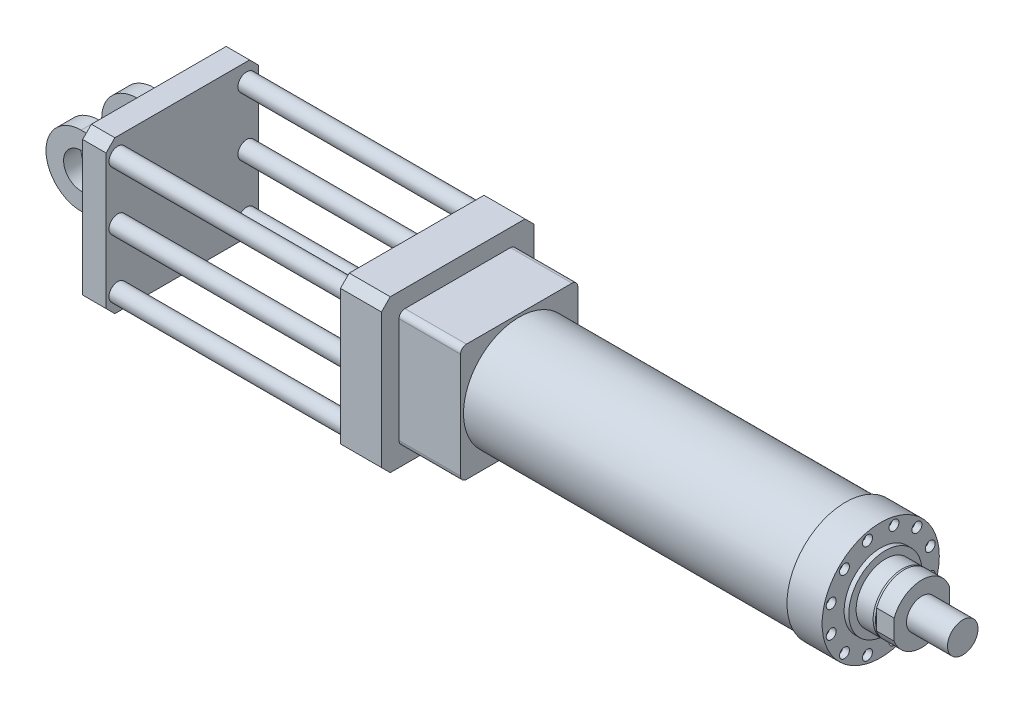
from build123d import *

# Parameters (mm, degrees)
SKETCH_1_R          = 95
SKETCH_1_R_2        = 80
EXTRUDE_1_DEPTH     = 557
SKETCH_2_R          = 100
EXTRUDE_2_DEPTH     = 60
SKETCH_3_R          = 62.5
EXTRUDE_3_DEPTH     = 8
SKETCH_4_R          = 8.5
CUT_EXTRUDE_3_DEPTH = 11
SKETCH_6_R          = 50
EXTRUDE_4_DEPTH     = 32
CHAMFER_1_SIZE      = 3
CHAMFER_1_SIZE2     = 1.091910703
EXTRUDE_5_DEPTH     = 30
SKETCH_8_R          = 26
CUT_EXTRUDE_4_DEPTH = 82
EXTRUDE_6_DEPTH     = 105
SKETCH_10_W         = 260
SKETCH_10_H         = 260
EXTRUDE_7_DEPTH     = 70
SKETCH_11_R         = 65
CUT_EXTRUDE_5_DEPTH = 30
SKETCH_12_R         = 55
CUT_EXTRUDE_6_DEPTH = 31
SKETCH_13_R         = 5
CUT_EXTRUDE_7_DEPTH = 20
EXTRUDE_START       = 70
SKETCH_14_R         = 26
EXTRUDE_8_DEPTH     = 70
EXTRUDE_START_2     = 400
SKETCH_15_W         = 260
SKETCH_15_H         = 260
EXTRUDE_9_DEPTH     = 40
SKETCH_16_R         = 15
EXTRUDE_10_DEPTH    = 400
SKETCH_17_W         = 30
SKETCH_17_H         = 120
EXTRUDE_11_DEPTH    = 130
SKETCH_18_R         = 30
CUT_EXTRUDE_8_DEPTH = 130
CHAMFER_2_SIZE      = 10
CHAMFER_3_SIZE      = 15
CHAMFER_4_SIZE      = 15


with BuildPart() as part:
    # Sketch 1 → Extrude 1 (new body)
    with BuildSketch(Plane(origin=(0, 0, 0), x_dir=(0, 0, -1), z_dir=(1, 0, 0))):
        Circle(SKETCH_1_R)
        Circle(SKETCH_1_R_2, mode=Mode.SUBTRACT)
    extrude(amount=EXTRUDE_1_DEPTH)

    # Sketch 2 → Extrude 2 (add)
    with BuildSketch(Plane(origin=(557, 0, 0), x_dir=(0, 0, -1), z_dir=(1, 0, 0))):
        Circle(SKETCH_2_R)
    extrude(amount=EXTRUDE_2_DEPTH)

    # Sketch 3 → Extrude 3 (add)
    with BuildSketch(Plane(origin=(617, 0, 0), x_dir=(0, 0, -1), z_dir=(1, 0, 0))):
        Circle(SKETCH_3_R)
    extrude(amount=EXTRUDE_3_DEPTH)

    # Sketch 4 → Cut-Extrude 3 (cut)
    with BuildSketch(Plane(origin=(617, 0, 0), x_dir=(0, 0, -1), z_dir=(1, 0, 0))):
        with Locations((-22.646666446, 84.5185098)):
            Circle(SKETCH_4_R)
        with Locations((22.646666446, 84.5185098)):
            Circle(SKETCH_4_R)
        with Locations((61.871843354, 61.871843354)):
            Circle(SKETCH_4_R)
        with Locations((84.5185098, 22.646666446)):
            Circle(SKETCH_4_R)
        with Locations((84.5185098, -22.646666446)):
            Circle(SKETCH_4_R)
        with Locations((61.871843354, -61.871843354)):
            Circle(SKETCH_4_R)
        with Locations((22.646666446, -84.5185098)):
            Circle(SKETCH_4_R)
        with Locations((-22.646666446, -84.5185098)):
            Circle(SKETCH_4_R)
        with Locations((-61.871843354, -61.871843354)):
            Circle(SKETCH_4_R)
        with Locations((-84.5185098, -22.646666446)):
            Circle(SKETCH_4_R)
        with Locations((-84.5185098, 22.646666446)):
            Circle(SKETCH_4_R)
        with Locations((-61.871843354, 61.871843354)):
            Circle(SKETCH_4_R)
    extrude(amount=-CUT_EXTRUDE_3_DEPTH, mode=Mode.SUBTRACT)

    # Sketch 6 → Extrude 4 (add)
    with BuildSketch(Plane(origin=(625, 0, 0), x_dir=(0, 0, -1), z_dir=(1, 0, 0))):
        Circle(SKETCH_6_R)
    extrude(amount=EXTRUDE_4_DEPTH)

    # Chamfer 1
    chamfer_1_edges = [part.edges().sort_by_distance(p)[0] for p in [
        (657, 0, 50),
    ]]
    chamfer_1_side = [part.faces().sort_by_distance(p)[0] for p in [
        (641, 0, 50),
    ]]
    chamfer(chamfer_1_edges, length=CHAMFER_1_SIZE, length2=CHAMFER_1_SIZE2, reference=chamfer_1_side[0])

    # Sketch 7 → Extrude 5 (add)
    with BuildSketch(Plane(origin=(657, 0, 0), x_dir=(0, 0, -1), z_dir=(1, 0, 0))):
        with BuildLine():
            Line((-47, 17.058722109), (-47, -17.058722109))
            ThreePointArc((-47, -17.058722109), (0, -50), (47, -17.058722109))
            Line((47, -17.058722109), (47, 17.058722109))
            ThreePointArc((47, 17.058722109), (0, 50), (-47, 17.058722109))
        make_face()
    extrude(amount=EXTRUDE_5_DEPTH)

    # Sketch 8 → Cut-Extrude 4 (cut)
    with BuildSketch(Plane(origin=(687, 0, 0), x_dir=(0, 0, -1), z_dir=(1, 0, 0))):
        Circle(SKETCH_8_R)
    extrude(amount=-CUT_EXTRUDE_4_DEPTH, mode=Mode.SUBTRACT)

    # Sketch 9 → Extrude 6 (add)
    with BuildSketch(Plane.ZY):
        with BuildLine():
            Line((-90, 100), (90, 100))
            ThreePointArc((90, 100), (97.071067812, 97.071067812), (100, 90))
            Line((100, 90), (100, -90))
            ThreePointArc((100, -90), (97.071067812, -97.071067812), (90, -100))
            Line((90, -100), (-90, -100))
            ThreePointArc((-90, -100), (-97.071067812, -97.071067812), (-100, -90))
            Line((-100, -90), (-100, 90))
            ThreePointArc((-100, 90), (-97.071067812, 97.071067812), (-90, 100))
        make_face()
    extrude(amount=EXTRUDE_6_DEPTH)


with BuildPart() as body_2:
    # Sketch 10 → Extrude 7 (new body)
    with BuildSketch(Plane.ZY.offset(105)):
        Rectangle(SKETCH_10_W, SKETCH_10_H)
    extrude(amount=EXTRUDE_7_DEPTH)

    # Sketch 11 → Cut-Extrude 5 (cut)
    with BuildSketch(Plane.ZY.offset(175)):
        Circle(SKETCH_11_R)
    extrude(amount=-CUT_EXTRUDE_5_DEPTH, mode=Mode.SUBTRACT)

    # Sketch 12 → Cut-Extrude 6 (cut)
    with BuildSketch(Plane.ZY.offset(145)):
        Circle(SKETCH_12_R)
    extrude(amount=-CUT_EXTRUDE_6_DEPTH, mode=Mode.SUBTRACT)

    # Sketch 13 → Cut-Extrude 7 (cut)
    with BuildSketch(Plane.ZY.offset(175)):
        with Locations((-58.336309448, 58.336309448)):
            Circle(SKETCH_13_R)
        with Locations((58.336309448, 58.336309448)):
            Circle(SKETCH_13_R)
        with Locations((58.336309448, -58.336309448)):
            Circle(SKETCH_13_R)
        with Locations((-58.336309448, -58.336309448)):
            Circle(SKETCH_13_R)
    extrude(amount=-CUT_EXTRUDE_7_DEPTH, mode=Mode.SUBTRACT)

    # Sketch 16 → Extrude 10 (add)
    with BuildSketch(Plane.ZY.offset(175)):
        with Locations((110, 100)):
            Circle(SKETCH_16_R)
        with Locations((110, -100)):
            Circle(SKETCH_16_R)
        with Locations((-110, 0)):
            Circle(SKETCH_16_R)
        with Locations(Location((-110, -100, 0), (0, 0, 180))):
            Circle(SKETCH_16_R)
        with Locations(Location((-110, 100, 0), (0, 0, 180))):
            Circle(SKETCH_16_R)
        with Locations((110, 0)):
            Circle(SKETCH_16_R)
    extrude(amount=EXTRUDE_10_DEPTH)

    # Chamfer 3
    chamfer_3_edges = [body_2.edges().sort_by_distance(p)[0] for p in [
        (-140, -130, 130),
        (-140, -130, -130),
        (-140, 130, -130),
        (-140, 130, 130),
    ]]
    chamfer(chamfer_3_edges, length=CHAMFER_3_SIZE)


with BuildPart() as body_3:
    # Sketch 14 → Extrude 8 (new body)
    with BuildSketch(Plane(origin=(687, 0, 0), x_dir=(0, 0, -1), z_dir=(1, 0, 0)).offset(EXTRUDE_START)):
        Circle(SKETCH_14_R)
    extrude(amount=-EXTRUDE_8_DEPTH)


with BuildPart() as body_4:
    # Sketch 15 → Extrude 9 (new body)
    with BuildSketch(Plane.ZY.offset(175).offset(EXTRUDE_START_2)):
        Rectangle(SKETCH_15_W, SKETCH_15_H)
    extrude(amount=EXTRUDE_9_DEPTH)

    # Sketch 17 → Extrude 11 (add)
    with BuildSketch(Plane.ZY.offset(615)):
        with Locations((-47.5, 0)):
            Rectangle(SKETCH_17_W, SKETCH_17_H)
        with Locations((47.5, 0)):
            Rectangle(SKETCH_17_W, SKETCH_17_H)
    extrude(amount=EXTRUDE_11_DEPTH)

    # Sketch 18 → Cut-Extrude 8 (cut)
    with BuildSketch(Plane.XY.offset(62.5)):
        with Locations((-685, 0)):
            Circle(SKETCH_18_R)
        with BuildLine():
            Line((-685, 60), (-850.932928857, 82.095369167))
            Line((-850.932928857, 82.095369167), (-803.822889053, -103.100854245))
            Line((-803.822889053, -103.100854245), (-685, -60))
            ThreePointArc((-685, -60), (-745, 0), (-685, 60))
        make_face()
    extrude(amount=-CUT_EXTRUDE_8_DEPTH, mode=Mode.SUBTRACT)

    # Chamfer 2
    chamfer_2_edges = [body_4.edges().sort_by_distance(p)[0] for p in [
        (-615, 0, -32.5),
        (-615, 60, -47.5),
        (-615, 0, -62.5),
        (-615, -60, -47.5),
        (-615, 0, 62.5),
        (-615, 60, 47.5),
        (-615, 0, 32.5),
        (-615, -60, 47.5),
    ]]
    chamfer(chamfer_2_edges, length=CHAMFER_2_SIZE)

    # Chamfer 4
    chamfer_4_edges = [body_4.edges().sort_by_distance(p)[0] for p in [
        (-595, -130, 130),
        (-595, -130, -130),
        (-595, 130, -130),
        (-595, 130, 130),
    ]]
    chamfer(chamfer_4_edges, length=CHAMFER_4_SIZE)


solid = Compound([part.part, body_2.part, body_3.part, body_4.part])
